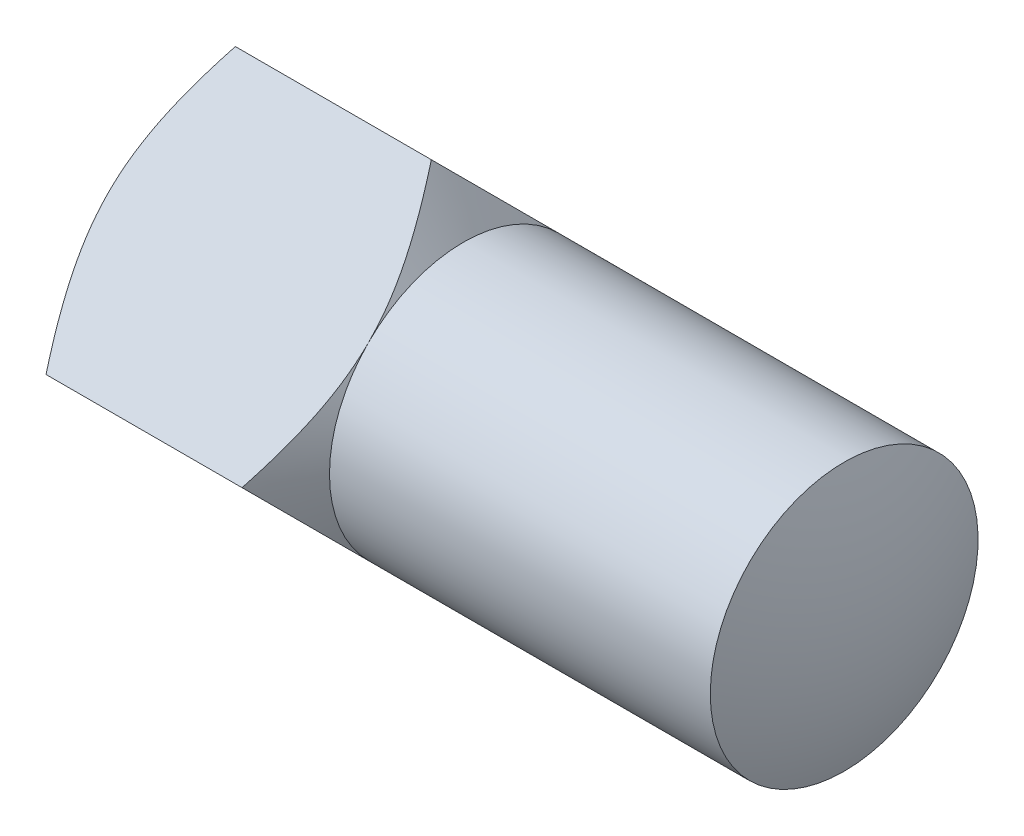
from build123d import *

# Parameters (mm, degrees)
BASEHEAD_DEPTH = 4


with BuildPart() as part:
    # BaseHeadSke → BaseHead (new body)
    with BuildSketch(Plane(origin=(0, 0, 0), x_dir=(0, 0, -1), z_dir=(1, 0, 0))):
        Polygon((0, 2.828427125), (2.828427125, 0), (0, -2.828427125), (-2.828427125, 0), align=None)
    extrude(amount=BASEHEAD_DEPTH)

    # HeadChamferSke → HeadChamfer (revolve, cut)
    with BuildSketch(Plane.XY, mode=Mode.PRIVATE) as headchamfer_sk:
        Polygon((0, 2.828427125), (0, 1.9), (0.53602765, 2.828427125), align=None)
        Polygon((3.46397235, 2.828427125), (4, 1.9), (4, 2.828427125), align=None)
    revolve(headchamfer_sk.sketch.rotate(Axis((0, 0, 0), (1, 0, 0)), 270), axis=Axis((0, 0, 0), (1, 0, 0)), mode=Mode.SUBTRACT)

    # BodySke → BaseBody (revolve)
    with BuildSketch(Plane.XY, mode=Mode.PRIVATE) as basebody_sk:
        with BuildLine():
            Line((3.46397235, 2), (9.630678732, 2))
            ThreePointArc((9.630678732, 2), (9.906895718, 1.016906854), (10, 0))
            Line((10, 0), (3.46397235, 0))
            Line((3.46397235, 0), (3.46397235, 2))
        make_face()
    revolve(basebody_sk.sketch.rotate(Axis((0, 0, 0), (1, 0, 0)), 180), axis=Axis((0, 0, 0), (1, 0, 0)))


solid = part.part
